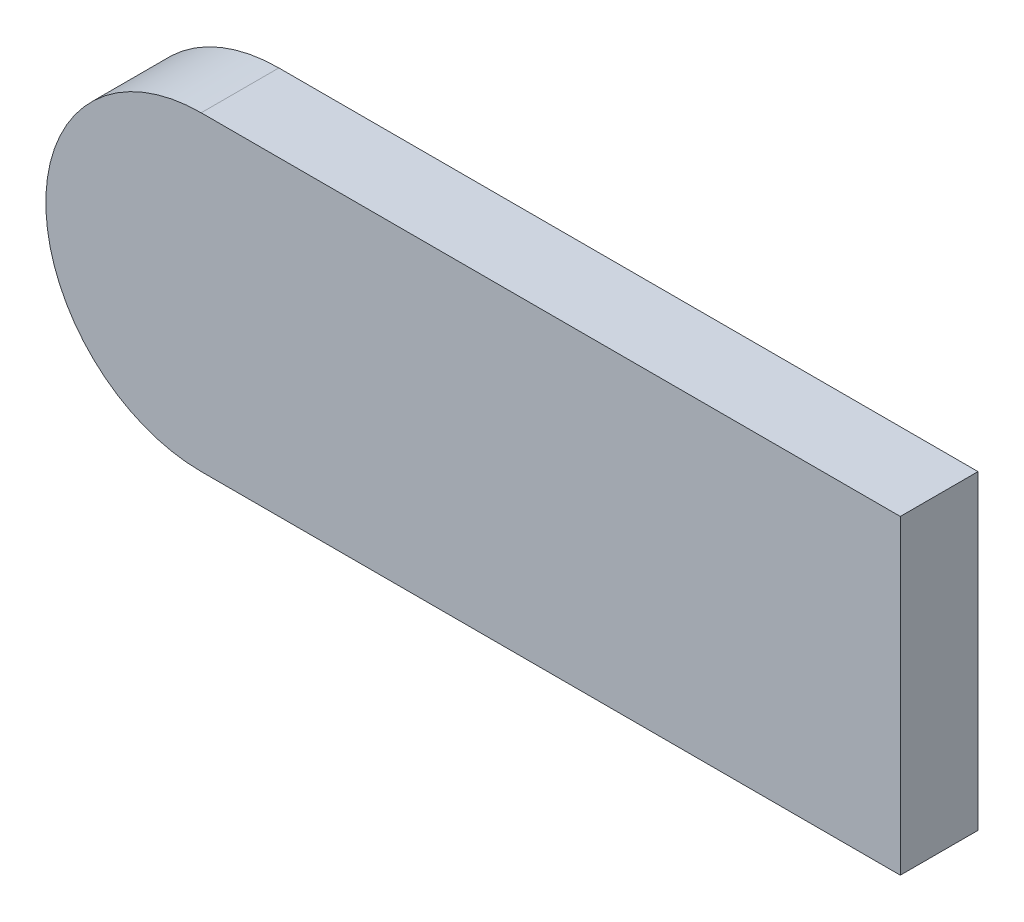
ISO-10303-21;
HEADER;
FILE_DESCRIPTION(('STEP AP214'),'2;1');
FILE_NAME('part.step','',(''),(''),'','','');
FILE_SCHEMA(('AUTOMOTIVE_DESIGN { 1 0 10303 214 1 1 1 1 }'));
ENDSEC;
DATA;
#1=APPLICATION_CONTEXT('core data for automotive mechanical design processes');
#2=APPLICATION_PROTOCOL_DEFINITION('international standard','automotive_design',2000,#1);
#3=PRODUCT_CONTEXT('',#1,'mechanical');
#4=PRODUCT('Part','Part','',(#3));
#5=PRODUCT_RELATED_PRODUCT_CATEGORY('part','',(#4));
#6=PRODUCT_DEFINITION_FORMATION('','',#4);
#7=PRODUCT_DEFINITION_CONTEXT('part definition',#1,'design');
#8=PRODUCT_DEFINITION('design','',#6,#7);
#9=PRODUCT_DEFINITION_SHAPE('','',#8);
#10=(LENGTH_UNIT() NAMED_UNIT(*) SI_UNIT(.MILLI.,.METRE.));
#11=(NAMED_UNIT(*) PLANE_ANGLE_UNIT() SI_UNIT($,.RADIAN.));
#12=(NAMED_UNIT(*) SI_UNIT($,.STERADIAN.) SOLID_ANGLE_UNIT());
#13=UNCERTAINTY_MEASURE_WITH_UNIT(LENGTH_MEASURE(1.E-05),#10,'distance_accuracy_value','');
#14=(GEOMETRIC_REPRESENTATION_CONTEXT(3) GLOBAL_UNCERTAINTY_ASSIGNED_CONTEXT((#13)) GLOBAL_UNIT_ASSIGNED_CONTEXT((#10,
#11,#12)) REPRESENTATION_CONTEXT('',''));
#15=CARTESIAN_POINT('',(0.,0.,0.));
#16=DIRECTION('',(0.,0.,1.));
#17=DIRECTION('',(1.,0.,0.));
#18=AXIS2_PLACEMENT_3D('',#15,#16,#17);
#19=CARTESIAN_POINT('',(45.,20.,10.));
#20=DIRECTION('',(-1.,0.,0.));
#21=DIRECTION('',(0.,0.,1.));
#22=AXIS2_PLACEMENT_3D('',#19,#20,#21);
#23=PLANE('',#22);
#24=DIRECTION('',(0.,1.,0.));
#25=VECTOR('',#24,1.);
#26=CARTESIAN_POINT('',(45.,20.,0.));
#27=LINE('',#26,#25);
#28=CARTESIAN_POINT('',(45.,-20.,0.));
#29=VERTEX_POINT('',#28);
#30=CARTESIAN_POINT('',(45.,20.,0.));
#31=VERTEX_POINT('',#30);
#32=EDGE_CURVE('E107',#29,#31,#27,.T.);
#33=ORIENTED_EDGE('',*,*,#32,.T.);
#34=DIRECTION('',(0.,0.,-1.));
#35=VECTOR('',#34,1.);
#36=CARTESIAN_POINT('',(45.,20.,10.));
#37=LINE('',#36,#35);
#38=CARTESIAN_POINT('',(45.,20.,10.));
#39=VERTEX_POINT('',#38);
#40=EDGE_CURVE('E11',#39,#31,#37,.T.);
#41=ORIENTED_EDGE('',*,*,#40,.F.);
#42=DIRECTION('',(0.,1.,0.));
#43=VECTOR('',#42,1.);
#44=CARTESIAN_POINT('',(45.,20.,10.));
#45=LINE('',#44,#43);
#46=CARTESIAN_POINT('',(45.,-20.,10.));
#47=VERTEX_POINT('',#46);
#48=EDGE_CURVE('E91',#47,#39,#45,.T.);
#49=ORIENTED_EDGE('',*,*,#48,.F.);
#50=DIRECTION('',(0.,0.,-1.));
#51=VECTOR('',#50,1.);
#52=CARTESIAN_POINT('',(45.,-20.,10.));
#53=LINE('',#52,#51);
#54=EDGE_CURVE('E103',#47,#29,#53,.T.);
#55=ORIENTED_EDGE('',*,*,#54,.T.);
#56=EDGE_LOOP('',(#33,#41,#49,#55));
#57=FACE_BOUND('',#56,.T.);
#58=ADVANCED_FACE('F39',(#57),#23,.F.);
#59=CARTESIAN_POINT('',(-45.,20.,10.));
#60=DIRECTION('',(0.,-1.,0.));
#61=DIRECTION('',(0.,0.,-1.));
#62=AXIS2_PLACEMENT_3D('',#59,#60,#61);
#63=PLANE('',#62);
#64=DIRECTION('',(-1.,0.,0.));
#65=VECTOR('',#64,1.);
#66=CARTESIAN_POINT('',(-45.,20.,0.));
#67=LINE('',#66,#65);
#68=CARTESIAN_POINT('',(-45.,20.,0.));
#69=VERTEX_POINT('',#68);
#70=EDGE_CURVE('E96',#31,#69,#67,.T.);
#71=ORIENTED_EDGE('',*,*,#70,.T.);
#72=DIRECTION('',(0.,0.,-1.));
#73=VECTOR('',#72,1.);
#74=CARTESIAN_POINT('',(-45.,20.,10.));
#75=LINE('',#74,#73);
#76=CARTESIAN_POINT('',(-45.,20.,10.));
#77=VERTEX_POINT('',#76);
#78=EDGE_CURVE('E48',#77,#69,#75,.T.);
#79=ORIENTED_EDGE('',*,*,#78,.F.);
#80=DIRECTION('',(-1.,0.,0.));
#81=VECTOR('',#80,1.);
#82=CARTESIAN_POINT('',(-45.,20.,10.));
#83=LINE('',#82,#81);
#84=EDGE_CURVE('E86',#39,#77,#83,.T.);
#85=ORIENTED_EDGE('',*,*,#84,.F.);
#86=ORIENTED_EDGE('',*,*,#40,.T.);
#87=EDGE_LOOP('',(#71,#79,#85,#86));
#88=FACE_BOUND('',#87,.T.);
#89=ADVANCED_FACE('F95',(#88),#63,.F.);
#90=CARTESIAN_POINT('',(-45.,0.,10.));
#91=DIRECTION('',(0.,0.,-1.));
#92=DIRECTION('',(-1.,0.,0.));
#93=AXIS2_PLACEMENT_3D('',#90,#91,#92);
#94=CYLINDRICAL_SURFACE('',#93,20.);
#95=CARTESIAN_POINT('',(-45.,0.,0.));
#96=DIRECTION('',(0.,0.,1.));
#97=DIRECTION('',(1.,0.,0.));
#98=AXIS2_PLACEMENT_3D('',#95,#96,#97);
#99=CIRCLE('',#98,20.);
#100=CARTESIAN_POINT('',(-45.,-20.,0.));
#101=VERTEX_POINT('',#100);
#102=EDGE_CURVE('E73',#69,#101,#99,.T.);
#103=ORIENTED_EDGE('',*,*,#102,.T.);
#104=DIRECTION('',(0.,0.,-1.));
#105=VECTOR('',#104,1.);
#106=CARTESIAN_POINT('',(-45.,-20.,10.));
#107=LINE('',#106,#105);
#108=CARTESIAN_POINT('',(-45.,-20.,10.));
#109=VERTEX_POINT('',#108);
#110=EDGE_CURVE('E98',#109,#101,#107,.T.);
#111=ORIENTED_EDGE('',*,*,#110,.F.);
#112=CARTESIAN_POINT('',(-45.,0.,10.));
#113=DIRECTION('',(0.,0.,1.));
#114=DIRECTION('',(1.,0.,0.));
#115=AXIS2_PLACEMENT_3D('',#112,#113,#114);
#116=CIRCLE('',#115,20.);
#117=EDGE_CURVE('E89',#77,#109,#116,.T.);
#118=ORIENTED_EDGE('',*,*,#117,.F.);
#119=ORIENTED_EDGE('',*,*,#78,.T.);
#120=EDGE_LOOP('',(#103,#111,#118,#119));
#121=FACE_BOUND('',#120,.T.);
#122=ADVANCED_FACE('F99',(#121),#94,.T.);
#123=CARTESIAN_POINT('',(-45.,-20.,10.));
#124=DIRECTION('',(0.,1.,0.));
#125=DIRECTION('',(0.,0.,1.));
#126=AXIS2_PLACEMENT_3D('',#123,#124,#125);
#127=PLANE('',#126);
#128=DIRECTION('',(1.,0.,0.));
#129=VECTOR('',#128,1.);
#130=CARTESIAN_POINT('',(-45.,-20.,0.));
#131=LINE('',#130,#129);
#132=EDGE_CURVE('E79',#101,#29,#131,.T.);
#133=ORIENTED_EDGE('',*,*,#132,.T.);
#134=ORIENTED_EDGE('',*,*,#54,.F.);
#135=DIRECTION('',(1.,0.,0.));
#136=VECTOR('',#135,1.);
#137=CARTESIAN_POINT('',(-45.,-20.,10.));
#138=LINE('',#137,#136);
#139=EDGE_CURVE('E56',#109,#47,#138,.T.);
#140=ORIENTED_EDGE('',*,*,#139,.F.);
#141=ORIENTED_EDGE('',*,*,#110,.T.);
#142=EDGE_LOOP('',(#133,#134,#140,#141));
#143=FACE_BOUND('',#142,.T.);
#144=ADVANCED_FACE('F120',(#143),#127,.F.);
#145=CARTESIAN_POINT('',(-45.,0.,10.));
#146=DIRECTION('',(0.,0.,1.));
#147=DIRECTION('',(1.,0.,0.));
#148=AXIS2_PLACEMENT_3D('',#145,#146,#147);
#149=PLANE('',#148);
#150=ORIENTED_EDGE('',*,*,#48,.T.);
#151=ORIENTED_EDGE('',*,*,#84,.T.);
#152=ORIENTED_EDGE('',*,*,#117,.T.);
#153=ORIENTED_EDGE('',*,*,#139,.T.);
#154=EDGE_LOOP('',(#150,#151,#152,#153));
#155=FACE_BOUND('',#154,.T.);
#156=ADVANCED_FACE('F87',(#155),#149,.T.);
#157=CARTESIAN_POINT('',(-45.,0.,0.));
#158=DIRECTION('',(0.,0.,1.));
#159=DIRECTION('',(1.,0.,0.));
#160=AXIS2_PLACEMENT_3D('',#157,#158,#159);
#161=PLANE('',#160);
#162=ORIENTED_EDGE('',*,*,#32,.F.);
#163=ORIENTED_EDGE('',*,*,#132,.F.);
#164=ORIENTED_EDGE('',*,*,#102,.F.);
#165=ORIENTED_EDGE('',*,*,#70,.F.);
#166=EDGE_LOOP('',(#162,#163,#164,#165));
#167=FACE_BOUND('',#166,.T.);
#168=ADVANCED_FACE('F123',(#167),#161,.F.);
#169=CLOSED_SHELL('',(#58,#89,#122,#144,#156,#168));
#170=MANIFOLD_SOLID_BREP('B2',#169);
#171=ADVANCED_BREP_SHAPE_REPRESENTATION('',(#18,#170),#14);
#172=SHAPE_DEFINITION_REPRESENTATION(#9,#171);
ENDSEC;
END-ISO-10303-21;
